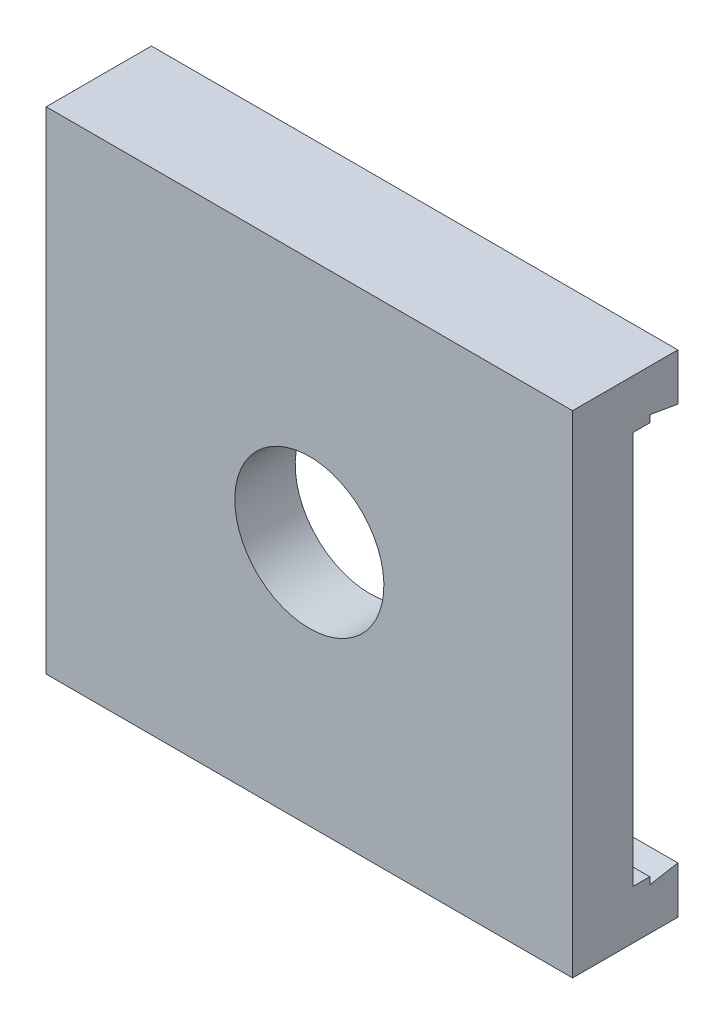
ISO-10303-21;
HEADER;
FILE_DESCRIPTION(('STEP AP214'),'2;1');
FILE_NAME('part.step','',(''),(''),'','','');
FILE_SCHEMA(('AUTOMOTIVE_DESIGN { 1 0 10303 214 1 1 1 1 }'));
ENDSEC;
DATA;
#1=APPLICATION_CONTEXT('core data for automotive mechanical design processes');
#2=APPLICATION_PROTOCOL_DEFINITION('international standard','automotive_design',2000,#1);
#3=PRODUCT_CONTEXT('',#1,'mechanical');
#4=PRODUCT('Part','Part','',(#3));
#5=PRODUCT_RELATED_PRODUCT_CATEGORY('part','',(#4));
#6=PRODUCT_DEFINITION_FORMATION('','',#4);
#7=PRODUCT_DEFINITION_CONTEXT('part definition',#1,'design');
#8=PRODUCT_DEFINITION('design','',#6,#7);
#9=PRODUCT_DEFINITION_SHAPE('','',#8);
#10=(LENGTH_UNIT() NAMED_UNIT(*) SI_UNIT(.MILLI.,.METRE.));
#11=(NAMED_UNIT(*) PLANE_ANGLE_UNIT() SI_UNIT($,.RADIAN.));
#12=(NAMED_UNIT(*) SI_UNIT($,.STERADIAN.) SOLID_ANGLE_UNIT());
#13=UNCERTAINTY_MEASURE_WITH_UNIT(LENGTH_MEASURE(1.E-05),#10,'distance_accuracy_value','');
#14=(GEOMETRIC_REPRESENTATION_CONTEXT(3) GLOBAL_UNCERTAINTY_ASSIGNED_CONTEXT((#13)) GLOBAL_UNIT_ASSIGNED_CONTEXT((#10,
#11,#12)) REPRESENTATION_CONTEXT('',''));
#15=CARTESIAN_POINT('',(0.,0.,0.));
#16=DIRECTION('',(0.,0.,1.));
#17=DIRECTION('',(1.,0.,0.));
#18=AXIS2_PLACEMENT_3D('',#15,#16,#17);
#19=CARTESIAN_POINT('',(23.8125,22.225,5.461));
#20=DIRECTION('',(0.,-1.,0.));
#21=DIRECTION('',(0.,0.,-1.));
#22=AXIS2_PLACEMENT_3D('',#19,#20,#21);
#23=PLANE('',#22);
#24=DIRECTION('',(0.,0.,1.));
#25=VECTOR('',#24,1.);
#26=CARTESIAN_POINT('',(-23.8125,22.225,5.461));
#27=LINE('',#26,#25);
#28=CARTESIAN_POINT('',(-23.8125,22.225,-4.064));
#29=VERTEX_POINT('',#28);
#30=CARTESIAN_POINT('',(-23.8125,22.225,5.461));
#31=VERTEX_POINT('',#30);
#32=EDGE_CURVE('E107',#29,#31,#27,.T.);
#33=ORIENTED_EDGE('',*,*,#32,.T.);
#34=DIRECTION('',(-1.,0.,0.));
#35=VECTOR('',#34,1.);
#36=CARTESIAN_POINT('',(23.8125,22.225,5.461));
#37=LINE('',#36,#35);
#38=CARTESIAN_POINT('',(23.8125,22.225,5.461));
#39=VERTEX_POINT('',#38);
#40=EDGE_CURVE('E9',#39,#31,#37,.T.);
#41=ORIENTED_EDGE('',*,*,#40,.F.);
#42=DIRECTION('',(0.,0.,1.));
#43=VECTOR('',#42,1.);
#44=CARTESIAN_POINT('',(23.8125,22.225,5.461));
#45=LINE('',#44,#43);
#46=CARTESIAN_POINT('',(23.8125,22.225,-4.064));
#47=VERTEX_POINT('',#46);
#48=EDGE_CURVE('E145',#47,#39,#45,.T.);
#49=ORIENTED_EDGE('',*,*,#48,.F.);
#50=DIRECTION('',(-1.,0.,0.));
#51=VECTOR('',#50,1.);
#52=CARTESIAN_POINT('',(23.8125,22.225,-4.064));
#53=LINE('',#52,#51);
#54=EDGE_CURVE('E120',#47,#29,#53,.T.);
#55=ORIENTED_EDGE('',*,*,#54,.T.);
#56=EDGE_LOOP('',(#33,#41,#49,#55));
#57=FACE_BOUND('',#56,.T.);
#58=ADVANCED_FACE('F14',(#57),#23,.F.);
#59=CARTESIAN_POINT('',(23.8125,-22.225,5.461));
#60=DIRECTION('',(0.,0.,-1.));
#61=DIRECTION('',(0.,1.,0.));
#62=AXIS2_PLACEMENT_3D('',#59,#60,#61);
#63=PLANE('',#62);
#64=CARTESIAN_POINT('',(0.,0.,5.461));
#65=DIRECTION('',(0.,0.,1.));
#66=DIRECTION('',(0.,-1.,0.));
#67=AXIS2_PLACEMENT_3D('',#64,#65,#66);
#68=CIRCLE('',#67,6.7437);
#69=CARTESIAN_POINT('',(0.,-6.7437,5.461));
#70=VERTEX_POINT('',#69);
#71=EDGE_CURVE('E123',#70,#70,#68,.T.);
#72=ORIENTED_EDGE('',*,*,#71,.F.);
#73=EDGE_LOOP('',(#72));
#74=FACE_BOUND('',#73,.T.);
#75=DIRECTION('',(0.,-1.,0.));
#76=VECTOR('',#75,1.);
#77=CARTESIAN_POINT('',(-23.8125,-22.225,5.461));
#78=LINE('',#77,#76);
#79=CARTESIAN_POINT('',(-23.8125,-22.225,5.461));
#80=VERTEX_POINT('',#79);
#81=EDGE_CURVE('E103',#31,#80,#78,.T.);
#82=ORIENTED_EDGE('',*,*,#81,.T.);
#83=DIRECTION('',(-1.,0.,0.));
#84=VECTOR('',#83,1.);
#85=CARTESIAN_POINT('',(23.8125,-22.225,5.461));
#86=LINE('',#85,#84);
#87=CARTESIAN_POINT('',(23.8125,-22.225,5.461));
#88=VERTEX_POINT('',#87);
#89=EDGE_CURVE('E22',#88,#80,#86,.T.);
#90=ORIENTED_EDGE('',*,*,#89,.F.);
#91=DIRECTION('',(0.,-1.,0.));
#92=VECTOR('',#91,1.);
#93=CARTESIAN_POINT('',(23.8125,-22.225,5.461));
#94=LINE('',#93,#92);
#95=EDGE_CURVE('E116',#39,#88,#94,.T.);
#96=ORIENTED_EDGE('',*,*,#95,.F.);
#97=ORIENTED_EDGE('',*,*,#40,.T.);
#98=EDGE_LOOP('',(#82,#90,#96,#97));
#99=FACE_BOUND('',#98,.T.);
#100=ADVANCED_FACE('F115',(#74,#99),#63,.F.);
#101=CARTESIAN_POINT('',(23.8125,-22.225,5.461));
#102=DIRECTION('',(0.,1.,0.));
#103=DIRECTION('',(0.,0.,1.));
#104=AXIS2_PLACEMENT_3D('',#101,#102,#103);
#105=PLANE('',#104);
#106=DIRECTION('',(0.,0.,-1.));
#107=VECTOR('',#106,1.);
#108=CARTESIAN_POINT('',(-23.8125,-22.225,5.461));
#109=LINE('',#108,#107);
#110=CARTESIAN_POINT('',(-23.8125,-22.225,-4.064));
#111=VERTEX_POINT('',#110);
#112=EDGE_CURVE('E109',#80,#111,#109,.T.);
#113=ORIENTED_EDGE('',*,*,#112,.T.);
#114=DIRECTION('',(-1.,0.,0.));
#115=VECTOR('',#114,1.);
#116=CARTESIAN_POINT('',(23.8125,-22.225,-4.064));
#117=LINE('',#116,#115);
#118=CARTESIAN_POINT('',(23.8125,-22.225,-4.064));
#119=VERTEX_POINT('',#118);
#120=EDGE_CURVE('E191',#119,#111,#117,.T.);
#121=ORIENTED_EDGE('',*,*,#120,.F.);
#122=DIRECTION('',(0.,0.,-1.));
#123=VECTOR('',#122,1.);
#124=CARTESIAN_POINT('',(23.8125,-22.225,5.461));
#125=LINE('',#124,#123);
#126=EDGE_CURVE('E148',#88,#119,#125,.T.);
#127=ORIENTED_EDGE('',*,*,#126,.F.);
#128=ORIENTED_EDGE('',*,*,#89,.T.);
#129=EDGE_LOOP('',(#113,#121,#127,#128));
#130=FACE_BOUND('',#129,.T.);
#131=ADVANCED_FACE('F196',(#130),#105,.F.);
#132=CARTESIAN_POINT('',(23.8125,-22.225,-4.064));
#133=DIRECTION('',(0.,0.,1.));
#134=DIRECTION('',(1.,0.,0.));
#135=AXIS2_PLACEMENT_3D('',#132,#133,#134);
#136=PLANE('',#135);
#137=DIRECTION('',(0.,1.,0.));
#138=VECTOR('',#137,1.);
#139=CARTESIAN_POINT('',(-23.8125,-22.225,-4.064));
#140=LINE('',#139,#138);
#141=CARTESIAN_POINT('',(-23.8125,-17.9705,-4.064));
#142=VERTEX_POINT('',#141);
#143=EDGE_CURVE('E127',#111,#142,#140,.T.);
#144=ORIENTED_EDGE('',*,*,#143,.T.);
#145=DIRECTION('',(-1.,0.,0.));
#146=VECTOR('',#145,1.);
#147=CARTESIAN_POINT('',(23.8125,-17.9705,-4.064));
#148=LINE('',#147,#146);
#149=CARTESIAN_POINT('',(23.8125,-17.9705,-4.064));
#150=VERTEX_POINT('',#149);
#151=EDGE_CURVE('E188',#150,#142,#148,.T.);
#152=ORIENTED_EDGE('',*,*,#151,.F.);
#153=DIRECTION('',(0.,1.,0.));
#154=VECTOR('',#153,1.);
#155=CARTESIAN_POINT('',(23.8125,-22.225,-4.064));
#156=LINE('',#155,#154);
#157=EDGE_CURVE('E150',#119,#150,#156,.T.);
#158=ORIENTED_EDGE('',*,*,#157,.F.);
#159=ORIENTED_EDGE('',*,*,#120,.T.);
#160=EDGE_LOOP('',(#144,#152,#158,#159));
#161=FACE_BOUND('',#160,.T.);
#162=ADVANCED_FACE('F204',(#161),#136,.F.);
#163=CARTESIAN_POINT('',(23.8125,-17.9705,-4.064));
#164=DIRECTION('',(0.,-0.984807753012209,-0.173648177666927));
#165=DIRECTION('',(0.,0.173648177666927,-0.984807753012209));
#166=AXIS2_PLACEMENT_3D('',#163,#164,#165);
#167=PLANE('',#166);
#168=DIRECTION('',(0.,-0.173648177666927,0.984807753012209));
#169=VECTOR('',#168,1.);
#170=CARTESIAN_POINT('',(-23.8125,-17.9705,-4.064));
#171=LINE('',#170,#169);
#172=CARTESIAN_POINT('',(-23.8125,-18.4183705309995,-1.524));
#173=VERTEX_POINT('',#172);
#174=EDGE_CURVE('E129',#142,#173,#171,.T.);
#175=ORIENTED_EDGE('',*,*,#174,.T.);
#176=DIRECTION('',(-1.,0.,0.));
#177=VECTOR('',#176,1.);
#178=CARTESIAN_POINT('',(23.8125,-18.4183705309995,-1.524));
#179=LINE('',#178,#177);
#180=CARTESIAN_POINT('',(23.8125,-18.4183705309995,-1.524));
#181=VERTEX_POINT('',#180);
#182=EDGE_CURVE('E185',#181,#173,#179,.T.);
#183=ORIENTED_EDGE('',*,*,#182,.F.);
#184=DIRECTION('',(0.,-0.173648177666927,0.984807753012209));
#185=VECTOR('',#184,1.);
#186=CARTESIAN_POINT('',(23.8125,-17.9705,-4.064));
#187=LINE('',#186,#185);
#188=EDGE_CURVE('E152',#150,#181,#187,.T.);
#189=ORIENTED_EDGE('',*,*,#188,.F.);
#190=ORIENTED_EDGE('',*,*,#151,.T.);
#191=EDGE_LOOP('',(#175,#183,#189,#190));
#192=FACE_BOUND('',#191,.T.);
#193=ADVANCED_FACE('F207',(#192),#167,.F.);
#194=CARTESIAN_POINT('',(23.8125,-18.4183705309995,-1.524));
#195=DIRECTION('',(0.,0.,1.));
#196=DIRECTION('',(0.,-1.,0.));
#197=AXIS2_PLACEMENT_3D('',#194,#195,#196);
#198=PLANE('',#197);
#199=DIRECTION('',(0.,1.,0.));
#200=VECTOR('',#199,1.);
#201=CARTESIAN_POINT('',(-23.8125,-18.4183705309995,-1.524));
#202=LINE('',#201,#200);
#203=CARTESIAN_POINT('',(-23.8125,-17.78,-1.524));
#204=VERTEX_POINT('',#203);
#205=EDGE_CURVE('E131',#173,#204,#202,.T.);
#206=ORIENTED_EDGE('',*,*,#205,.T.);
#207=DIRECTION('',(-1.,0.,0.));
#208=VECTOR('',#207,1.);
#209=CARTESIAN_POINT('',(23.8125,-17.78,-1.524));
#210=LINE('',#209,#208);
#211=CARTESIAN_POINT('',(23.8125,-17.78,-1.524));
#212=VERTEX_POINT('',#211);
#213=EDGE_CURVE('E182',#212,#204,#210,.T.);
#214=ORIENTED_EDGE('',*,*,#213,.F.);
#215=DIRECTION('',(0.,1.,0.));
#216=VECTOR('',#215,1.);
#217=CARTESIAN_POINT('',(23.8125,-18.4183705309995,-1.524));
#218=LINE('',#217,#216);
#219=EDGE_CURVE('E154',#181,#212,#218,.T.);
#220=ORIENTED_EDGE('',*,*,#219,.F.);
#221=ORIENTED_EDGE('',*,*,#182,.T.);
#222=EDGE_LOOP('',(#206,#214,#220,#221));
#223=FACE_BOUND('',#222,.T.);
#224=ADVANCED_FACE('F212',(#223),#198,.F.);
#225=CARTESIAN_POINT('',(23.8125,-17.78,-1.524));
#226=DIRECTION('',(0.,-1.,0.));
#227=DIRECTION('',(1.,0.,0.));
#228=AXIS2_PLACEMENT_3D('',#225,#226,#227);
#229=PLANE('',#228);
#230=DIRECTION('',(0.,0.,1.));
#231=VECTOR('',#230,1.);
#232=CARTESIAN_POINT('',(-23.8125,-17.78,-1.524));
#233=LINE('',#232,#231);
#234=CARTESIAN_POINT('',(-23.8125,-17.78,0.));
#235=VERTEX_POINT('',#234);
#236=EDGE_CURVE('E133',#204,#235,#233,.T.);
#237=ORIENTED_EDGE('',*,*,#236,.T.);
#238=DIRECTION('',(-1.,0.,0.));
#239=VECTOR('',#238,1.);
#240=CARTESIAN_POINT('',(23.8125,-17.78,0.));
#241=LINE('',#240,#239);
#242=CARTESIAN_POINT('',(23.8125,-17.78,0.));
#243=VERTEX_POINT('',#242);
#244=EDGE_CURVE('E179',#243,#235,#241,.T.);
#245=ORIENTED_EDGE('',*,*,#244,.F.);
#246=DIRECTION('',(0.,0.,1.));
#247=VECTOR('',#246,1.);
#248=CARTESIAN_POINT('',(23.8125,-17.78,-1.524));
#249=LINE('',#248,#247);
#250=EDGE_CURVE('E156',#212,#243,#249,.T.);
#251=ORIENTED_EDGE('',*,*,#250,.F.);
#252=ORIENTED_EDGE('',*,*,#213,.T.);
#253=EDGE_LOOP('',(#237,#245,#251,#252));
#254=FACE_BOUND('',#253,.T.);
#255=ADVANCED_FACE('F218',(#254),#229,.F.);
#256=CARTESIAN_POINT('',(23.8125,17.78,0.));
#257=DIRECTION('',(0.,0.,1.));
#258=DIRECTION('',(0.,-1.,0.));
#259=AXIS2_PLACEMENT_3D('',#256,#257,#258);
#260=PLANE('',#259);
#261=CARTESIAN_POINT('',(0.,0.,0.));
#262=DIRECTION('',(0.,0.,1.));
#263=DIRECTION('',(0.,-1.,0.));
#264=AXIS2_PLACEMENT_3D('',#261,#262,#263);
#265=CIRCLE('',#264,6.7437);
#266=CARTESIAN_POINT('',(0.,-6.7437,0.));
#267=VERTEX_POINT('',#266);
#268=EDGE_CURVE('E17',#267,#267,#265,.T.);
#269=ORIENTED_EDGE('',*,*,#268,.T.);
#270=EDGE_LOOP('',(#269));
#271=FACE_BOUND('',#270,.T.);
#272=DIRECTION('',(0.,1.,0.));
#273=VECTOR('',#272,1.);
#274=CARTESIAN_POINT('',(-23.8125,17.78,0.));
#275=LINE('',#274,#273);
#276=CARTESIAN_POINT('',(-23.8125,17.78,0.));
#277=VERTEX_POINT('',#276);
#278=EDGE_CURVE('E135',#235,#277,#275,.T.);
#279=ORIENTED_EDGE('',*,*,#278,.T.);
#280=DIRECTION('',(-1.,0.,0.));
#281=VECTOR('',#280,1.);
#282=CARTESIAN_POINT('',(23.8125,17.78,0.));
#283=LINE('',#282,#281);
#284=CARTESIAN_POINT('',(23.8125,17.78,0.));
#285=VERTEX_POINT('',#284);
#286=EDGE_CURVE('E176',#285,#277,#283,.T.);
#287=ORIENTED_EDGE('',*,*,#286,.F.);
#288=DIRECTION('',(0.,1.,0.));
#289=VECTOR('',#288,1.);
#290=CARTESIAN_POINT('',(23.8125,17.78,0.));
#291=LINE('',#290,#289);
#292=EDGE_CURVE('E158',#243,#285,#291,.T.);
#293=ORIENTED_EDGE('',*,*,#292,.F.);
#294=ORIENTED_EDGE('',*,*,#244,.T.);
#295=EDGE_LOOP('',(#279,#287,#293,#294));
#296=FACE_BOUND('',#295,.T.);
#297=ADVANCED_FACE('F222',(#271,#296),#260,.F.);
#298=CARTESIAN_POINT('',(23.8125,17.78,-1.524));
#299=DIRECTION('',(0.,1.,0.));
#300=DIRECTION('',(-1.,0.,0.));
#301=AXIS2_PLACEMENT_3D('',#298,#299,#300);
#302=PLANE('',#301);
#303=DIRECTION('',(0.,0.,-1.));
#304=VECTOR('',#303,1.);
#305=CARTESIAN_POINT('',(-23.8125,17.78,-1.524));
#306=LINE('',#305,#304);
#307=CARTESIAN_POINT('',(-23.8125,17.78,-1.524));
#308=VERTEX_POINT('',#307);
#309=EDGE_CURVE('E137',#277,#308,#306,.T.);
#310=ORIENTED_EDGE('',*,*,#309,.T.);
#311=DIRECTION('',(-1.,0.,0.));
#312=VECTOR('',#311,1.);
#313=CARTESIAN_POINT('',(23.8125,17.78,-1.524));
#314=LINE('',#313,#312);
#315=CARTESIAN_POINT('',(23.8125,17.78,-1.524));
#316=VERTEX_POINT('',#315);
#317=EDGE_CURVE('E173',#316,#308,#314,.T.);
#318=ORIENTED_EDGE('',*,*,#317,.F.);
#319=DIRECTION('',(0.,0.,-1.));
#320=VECTOR('',#319,1.);
#321=CARTESIAN_POINT('',(23.8125,17.78,-1.524));
#322=LINE('',#321,#320);
#323=EDGE_CURVE('E160',#285,#316,#322,.T.);
#324=ORIENTED_EDGE('',*,*,#323,.F.);
#325=ORIENTED_EDGE('',*,*,#286,.T.);
#326=EDGE_LOOP('',(#310,#318,#324,#325));
#327=FACE_BOUND('',#326,.T.);
#328=ADVANCED_FACE('F227',(#327),#302,.F.);
#329=CARTESIAN_POINT('',(23.8125,18.4183705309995,-1.524));
#330=DIRECTION('',(0.,0.,1.));
#331=DIRECTION('',(0.,-1.,0.));
#332=AXIS2_PLACEMENT_3D('',#329,#330,#331);
#333=PLANE('',#332);
#334=DIRECTION('',(0.,1.,0.));
#335=VECTOR('',#334,1.);
#336=CARTESIAN_POINT('',(-23.8125,18.4183705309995,-1.524));
#337=LINE('',#336,#335);
#338=CARTESIAN_POINT('',(-23.8125,18.4183705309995,-1.524));
#339=VERTEX_POINT('',#338);
#340=EDGE_CURVE('E139',#308,#339,#337,.T.);
#341=ORIENTED_EDGE('',*,*,#340,.T.);
#342=DIRECTION('',(-1.,0.,0.));
#343=VECTOR('',#342,1.);
#344=CARTESIAN_POINT('',(23.8125,18.4183705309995,-1.524));
#345=LINE('',#344,#343);
#346=CARTESIAN_POINT('',(23.8125,18.4183705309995,-1.524));
#347=VERTEX_POINT('',#346);
#348=EDGE_CURVE('E170',#347,#339,#345,.T.);
#349=ORIENTED_EDGE('',*,*,#348,.F.);
#350=DIRECTION('',(0.,1.,0.));
#351=VECTOR('',#350,1.);
#352=CARTESIAN_POINT('',(23.8125,18.4183705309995,-1.524));
#353=LINE('',#352,#351);
#354=EDGE_CURVE('E162',#316,#347,#353,.T.);
#355=ORIENTED_EDGE('',*,*,#354,.F.);
#356=ORIENTED_EDGE('',*,*,#317,.T.);
#357=EDGE_LOOP('',(#341,#349,#355,#356));
#358=FACE_BOUND('',#357,.T.);
#359=ADVANCED_FACE('F231',(#358),#333,.F.);
#360=CARTESIAN_POINT('',(23.8125,17.9705,-4.064));
#361=DIRECTION('',(0.,0.984807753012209,-0.173648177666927));
#362=DIRECTION('',(0.,0.173648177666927,0.984807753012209));
#363=AXIS2_PLACEMENT_3D('',#360,#361,#362);
#364=PLANE('',#363);
#365=DIRECTION('',(0.,-0.173648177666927,-0.984807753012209));
#366=VECTOR('',#365,1.);
#367=CARTESIAN_POINT('',(-23.8125,17.9705,-4.064));
#368=LINE('',#367,#366);
#369=CARTESIAN_POINT('',(-23.8125,17.9705,-4.064));
#370=VERTEX_POINT('',#369);
#371=EDGE_CURVE('E141',#339,#370,#368,.T.);
#372=ORIENTED_EDGE('',*,*,#371,.T.);
#373=DIRECTION('',(-1.,0.,0.));
#374=VECTOR('',#373,1.);
#375=CARTESIAN_POINT('',(23.8125,17.9705,-4.064));
#376=LINE('',#375,#374);
#377=CARTESIAN_POINT('',(23.8125,17.9705,-4.064));
#378=VERTEX_POINT('',#377);
#379=EDGE_CURVE('E167',#378,#370,#376,.T.);
#380=ORIENTED_EDGE('',*,*,#379,.F.);
#381=DIRECTION('',(0.,-0.173648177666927,-0.984807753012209));
#382=VECTOR('',#381,1.);
#383=CARTESIAN_POINT('',(23.8125,17.9705,-4.064));
#384=LINE('',#383,#382);
#385=EDGE_CURVE('E34',#347,#378,#384,.T.);
#386=ORIENTED_EDGE('',*,*,#385,.F.);
#387=ORIENTED_EDGE('',*,*,#348,.T.);
#388=EDGE_LOOP('',(#372,#380,#386,#387));
#389=FACE_BOUND('',#388,.T.);
#390=ADVANCED_FACE('F235',(#389),#364,.F.);
#391=CARTESIAN_POINT('',(23.8125,22.225,-4.064));
#392=DIRECTION('',(0.,0.,1.));
#393=DIRECTION('',(1.,0.,0.));
#394=AXIS2_PLACEMENT_3D('',#391,#392,#393);
#395=PLANE('',#394);
#396=DIRECTION('',(0.,1.,0.));
#397=VECTOR('',#396,1.);
#398=CARTESIAN_POINT('',(-23.8125,22.225,-4.064));
#399=LINE('',#398,#397);
#400=EDGE_CURVE('E143',#370,#29,#399,.T.);
#401=ORIENTED_EDGE('',*,*,#400,.T.);
#402=ORIENTED_EDGE('',*,*,#54,.F.);
#403=DIRECTION('',(0.,1.,0.));
#404=VECTOR('',#403,1.);
#405=CARTESIAN_POINT('',(23.8125,22.225,-4.064));
#406=LINE('',#405,#404);
#407=EDGE_CURVE('E29',#378,#47,#406,.T.);
#408=ORIENTED_EDGE('',*,*,#407,.F.);
#409=ORIENTED_EDGE('',*,*,#379,.T.);
#410=EDGE_LOOP('',(#401,#402,#408,#409));
#411=FACE_BOUND('',#410,.T.);
#412=ADVANCED_FACE('F237',(#411),#395,.F.);
#413=CARTESIAN_POINT('',(23.8125,22.225,5.461));
#414=DIRECTION('',(1.,0.,0.));
#415=DIRECTION('',(0.,1.,0.));
#416=AXIS2_PLACEMENT_3D('',#413,#414,#415);
#417=PLANE('',#416);
#418=ORIENTED_EDGE('',*,*,#48,.T.);
#419=ORIENTED_EDGE('',*,*,#95,.T.);
#420=ORIENTED_EDGE('',*,*,#126,.T.);
#421=ORIENTED_EDGE('',*,*,#157,.T.);
#422=ORIENTED_EDGE('',*,*,#188,.T.);
#423=ORIENTED_EDGE('',*,*,#219,.T.);
#424=ORIENTED_EDGE('',*,*,#250,.T.);
#425=ORIENTED_EDGE('',*,*,#292,.T.);
#426=ORIENTED_EDGE('',*,*,#323,.T.);
#427=ORIENTED_EDGE('',*,*,#354,.T.);
#428=ORIENTED_EDGE('',*,*,#385,.T.);
#429=ORIENTED_EDGE('',*,*,#407,.T.);
#430=EDGE_LOOP('',(#418,#419,#420,#421,#422,#423,#424,#425,#426,#427,#428,#429));
#431=FACE_BOUND('',#430,.T.);
#432=ADVANCED_FACE('F199',(#431),#417,.T.);
#433=CARTESIAN_POINT('',(-23.8125,22.225,5.461));
#434=DIRECTION('',(1.,0.,0.));
#435=DIRECTION('',(0.,1.,0.));
#436=AXIS2_PLACEMENT_3D('',#433,#434,#435);
#437=PLANE('',#436);
#438=ORIENTED_EDGE('',*,*,#32,.F.);
#439=ORIENTED_EDGE('',*,*,#400,.F.);
#440=ORIENTED_EDGE('',*,*,#371,.F.);
#441=ORIENTED_EDGE('',*,*,#340,.F.);
#442=ORIENTED_EDGE('',*,*,#309,.F.);
#443=ORIENTED_EDGE('',*,*,#278,.F.);
#444=ORIENTED_EDGE('',*,*,#236,.F.);
#445=ORIENTED_EDGE('',*,*,#205,.F.);
#446=ORIENTED_EDGE('',*,*,#174,.F.);
#447=ORIENTED_EDGE('',*,*,#143,.F.);
#448=ORIENTED_EDGE('',*,*,#112,.F.);
#449=ORIENTED_EDGE('',*,*,#81,.F.);
#450=EDGE_LOOP('',(#438,#439,#440,#441,#442,#443,#444,#445,#446,#447,#448,#449));
#451=FACE_BOUND('',#450,.T.);
#452=ADVANCED_FACE('F104',(#451),#437,.F.);
#453=CARTESIAN_POINT('',(0.,0.,-4.064));
#454=DIRECTION('',(0.,0.,1.));
#455=DIRECTION('',(0.,-1.,0.));
#456=AXIS2_PLACEMENT_3D('',#453,#454,#455);
#457=CYLINDRICAL_SURFACE('',#456,6.7437);
#458=ORIENTED_EDGE('',*,*,#71,.T.);
#459=EDGE_LOOP('',(#458));
#460=FACE_BOUND('',#459,.T.);
#461=ORIENTED_EDGE('',*,*,#268,.F.);
#462=EDGE_LOOP('',(#461));
#463=FACE_BOUND('',#462,.T.);
#464=ADVANCED_FACE('F357',(#460,#463),#457,.F.);
#465=CLOSED_SHELL('',(#58,#100,#131,#162,#193,#224,#255,#297,#328,#359,#390,#412,#432,#452,#464));
#466=MANIFOLD_SOLID_BREP('B1',#465);
#467=ADVANCED_BREP_SHAPE_REPRESENTATION('',(#18,#466),#14);
#468=SHAPE_DEFINITION_REPRESENTATION(#9,#467);
ENDSEC;
END-ISO-10303-21;
